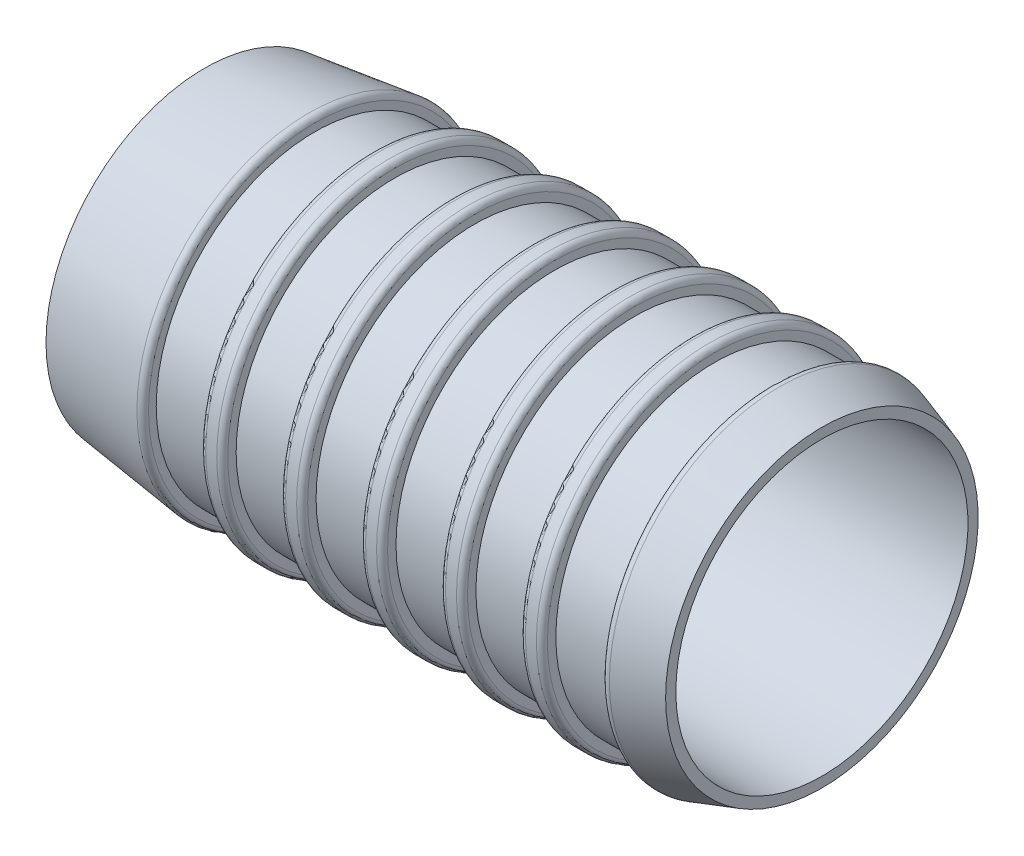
from build123d import *

# Parameters (mm, degrees)
CONG_1_R = 1


with BuildPart() as part:
    # Esquisse1 → R_volution1 (revolve)
    with BuildSketch(Plane.XY, mode=Mode.PRIVATE) as r_volution1_sk:
        Polygon((-10.086883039, 26.5), (101.913116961, 26.5), (101.913116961, 28.352912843), (92.913116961, 31.294813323), (92.913116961, 28.769640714), (82.413116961, 28.769640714), (82.413116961, 31.294813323), (78.413116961, 31.294813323), (78.413116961, 28.769640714), (67.913116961, 28.769640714), (67.913116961, 31.294813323), (63.913116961, 31.294813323), (63.913116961, 28.769640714), (53.413116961, 28.769640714), (53.413116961, 31.294813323), (49.413116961, 31.294813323), (49.413116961, 28.769640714), (38.913116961, 28.769640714), (38.913116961, 31.294813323), (34.913116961, 31.294813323), (34.913116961, 28.769640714), (24.413116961, 28.769640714), (24.413116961, 31.294813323), (20.413116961, 31.294813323), (20.413116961, 28.769640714), (9.913116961, 28.769640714), (9.913116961, 31.294813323), (-10.086883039, 28.769640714), align=None)
    revolve(r_volution1_sk.sketch.rotate(Axis((0, 0, 0), (1, 0, 0)), 90), axis=Axis((0, 0, 0), (1, 0, 0)))

    # Cong_1
    cong_1_edges = [part.edges().sort_by_distance(p)[0] for p in [
        (92.913116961, 0, -31.294813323),
        (82.413116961, 0, -31.294813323),
        (78.413116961, 0, -31.294813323),
        (67.913116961, 0, -31.294813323),
        (63.913116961, 0, -31.294813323),
        (53.413116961, 0, -31.294813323),
        (49.413116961, 0, -31.294813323),
        (38.913116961, 0, -31.294813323),
        (34.913116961, 0, -31.294813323),
        (24.413116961, 0, -31.294813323),
        (20.413116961, 0, -31.294813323),
        (9.913116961, 0, -31.294813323),
    ]]
    fillet(cong_1_edges, radius=CONG_1_R)


solid = part.part
